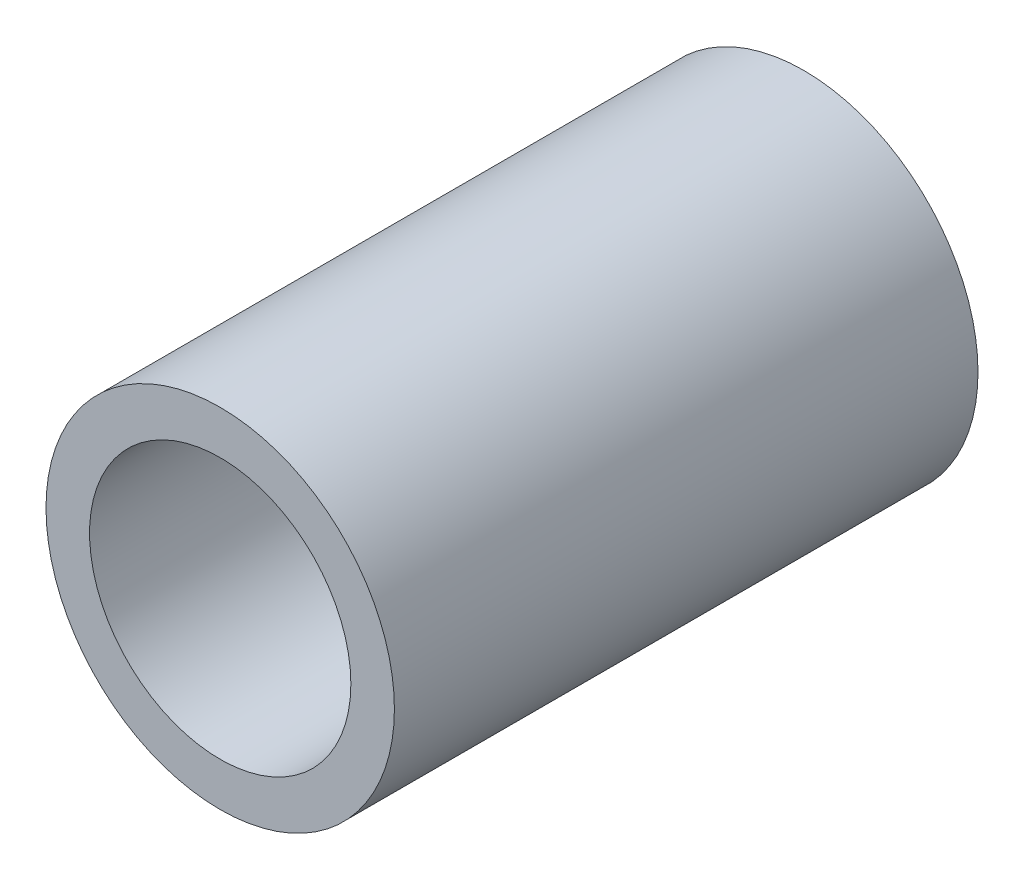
from build123d import *

# Parameters (mm, degrees)
ESQUISSE1_R      = 20
ESQUISSE1_R_2    = 15
EXTRUSION1_DEPTH = 67


with BuildPart() as part:
    # Esquisse1 → Extrusion1 (new body)
    with BuildSketch(Plane.XY):
        Circle(ESQUISSE1_R)
        Circle(ESQUISSE1_R_2, mode=Mode.SUBTRACT)
    extrude(amount=EXTRUSION1_DEPTH)


solid = part.part
